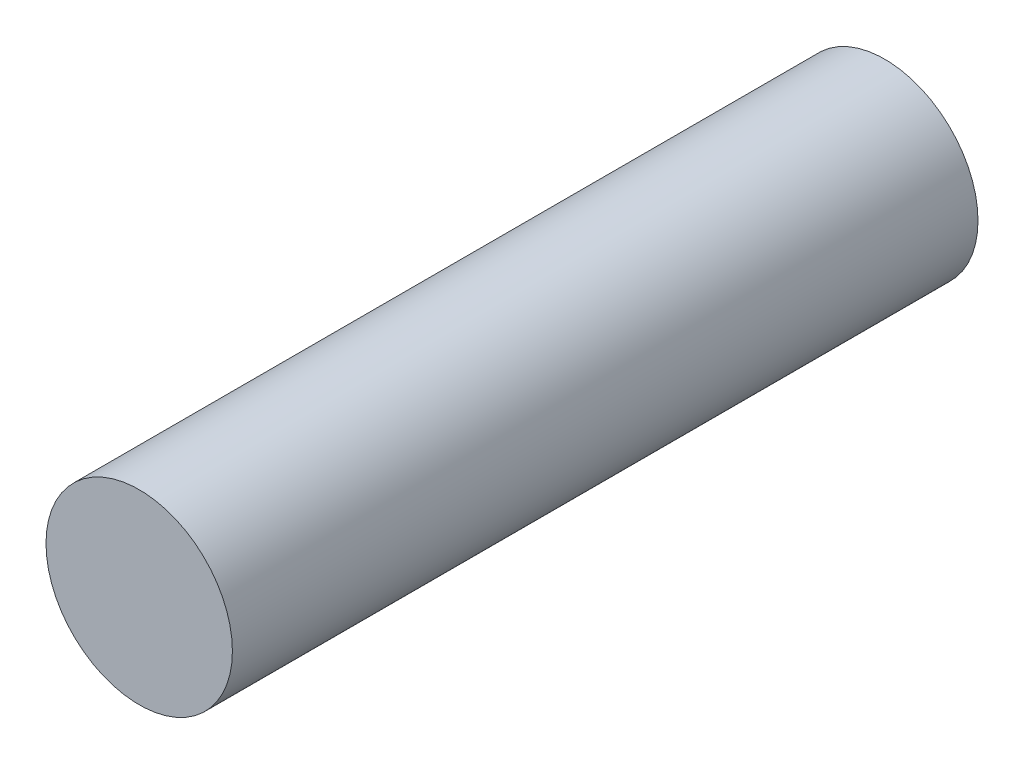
from build123d import *

# Parameters (mm, degrees)
SKIZZE1_R               = 4.75
LINEAR_AUSTRAGEN1_DEPTH = 38


with BuildPart() as part:
    # Skizze1 → Linear austragen1 (new body)
    with BuildSketch(Plane.XY):
        Circle(SKIZZE1_R)
    extrude(amount=LINEAR_AUSTRAGEN1_DEPTH)


solid = part.part
